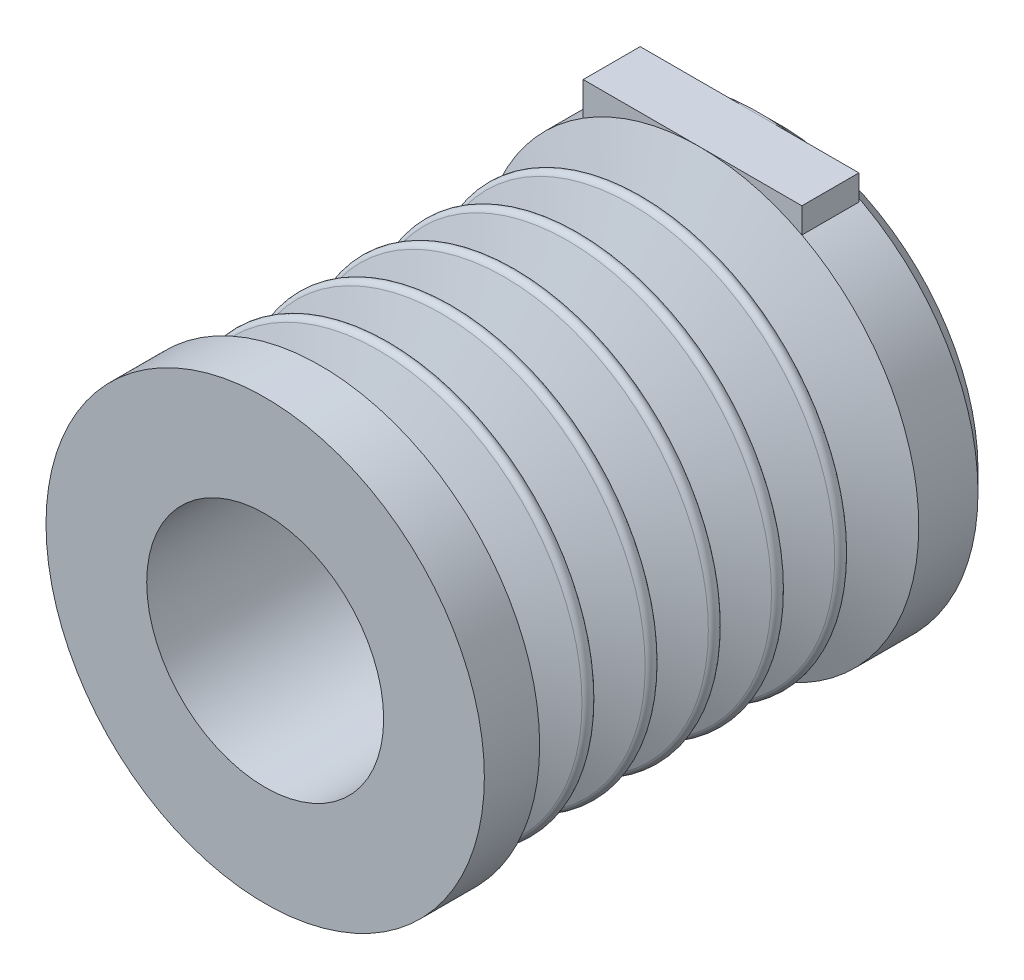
ISO-10303-21;
HEADER;
FILE_DESCRIPTION(('STEP AP214'),'2;1');
FILE_NAME('part.step','',(''),(''),'','','');
FILE_SCHEMA(('AUTOMOTIVE_DESIGN { 1 0 10303 214 1 1 1 1 }'));
ENDSEC;
DATA;
#1=APPLICATION_CONTEXT('core data for automotive mechanical design processes');
#2=APPLICATION_PROTOCOL_DEFINITION('international standard','automotive_design',2000,#1);
#3=PRODUCT_CONTEXT('',#1,'mechanical');
#4=PRODUCT('Part','Part','',(#3));
#5=PRODUCT_RELATED_PRODUCT_CATEGORY('part','',(#4));
#6=PRODUCT_DEFINITION_FORMATION('','',#4);
#7=PRODUCT_DEFINITION_CONTEXT('part definition',#1,'design');
#8=PRODUCT_DEFINITION('design','',#6,#7);
#9=PRODUCT_DEFINITION_SHAPE('','',#8);
#10=(LENGTH_UNIT() NAMED_UNIT(*) SI_UNIT(.MILLI.,.METRE.));
#11=(NAMED_UNIT(*) PLANE_ANGLE_UNIT() SI_UNIT($,.RADIAN.));
#12=(NAMED_UNIT(*) SI_UNIT($,.STERADIAN.) SOLID_ANGLE_UNIT());
#13=UNCERTAINTY_MEASURE_WITH_UNIT(LENGTH_MEASURE(1.E-05),#10,'distance_accuracy_value','');
#14=(GEOMETRIC_REPRESENTATION_CONTEXT(3) GLOBAL_UNCERTAINTY_ASSIGNED_CONTEXT((#13)) GLOBAL_UNIT_ASSIGNED_CONTEXT((#10,
#11,#12)) REPRESENTATION_CONTEXT('',''));
#15=CARTESIAN_POINT('',(0.,0.,0.));
#16=DIRECTION('',(0.,0.,1.));
#17=DIRECTION('',(1.,0.,0.));
#18=AXIS2_PLACEMENT_3D('',#15,#16,#17);
#19=CARTESIAN_POINT('',(0.,0.,21.5));
#20=DIRECTION('',(0.,0.,1.));
#21=DIRECTION('',(1.,0.,0.));
#22=AXIS2_PLACEMENT_3D('',#19,#20,#21);
#23=CYLINDRICAL_SURFACE('',#22,5.55);
#24=CARTESIAN_POINT('',(0.,0.,13.));
#25=DIRECTION('',(0.,0.,1.));
#26=DIRECTION('',(1.,0.,0.));
#27=AXIS2_PLACEMENT_3D('',#24,#25,#26);
#28=CIRCLE('',#27,5.55);
#29=CARTESIAN_POINT('',(5.55,0.,13.));
#30=VERTEX_POINT('',#29);
#31=EDGE_CURVE('E135',#30,#30,#28,.T.);
#32=ORIENTED_EDGE('',*,*,#31,.F.);
#33=EDGE_LOOP('',(#32));
#34=FACE_BOUND('',#33,.T.);
#35=CARTESIAN_POINT('',(0.,0.,11.6000000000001));
#36=DIRECTION('',(0.,0.,1.));
#37=DIRECTION('',(1.,0.,0.));
#38=AXIS2_PLACEMENT_3D('',#35,#36,#37);
#39=CIRCLE('',#38,5.55);
#40=CARTESIAN_POINT('',(5.55,0.,11.6000000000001));
#41=VERTEX_POINT('',#40);
#42=EDGE_CURVE('E119',#41,#41,#39,.T.);
#43=ORIENTED_EDGE('',*,*,#42,.T.);
#44=EDGE_LOOP('',(#43));
#45=FACE_BOUND('',#44,.T.);
#46=ADVANCED_FACE('F33',(#34,#45),#23,.T.);
#47=CARTESIAN_POINT('',(0.,5.55,13.));
#48=DIRECTION('',(0.,0.,-1.));
#49=DIRECTION('',(-1.,0.,0.));
#50=AXIS2_PLACEMENT_3D('',#47,#48,#49);
#51=PLANE('',#50);
#52=CARTESIAN_POINT('',(0.,0.,13.));
#53=DIRECTION('',(0.,0.,1.));
#54=DIRECTION('',(1.,0.,0.));
#55=AXIS2_PLACEMENT_3D('',#52,#53,#54);
#56=CIRCLE('',#55,3.);
#57=CARTESIAN_POINT('',(3.,0.,13.));
#58=VERTEX_POINT('',#57);
#59=EDGE_CURVE('E132',#58,#58,#56,.T.);
#60=ORIENTED_EDGE('',*,*,#59,.F.);
#61=EDGE_LOOP('',(#60));
#62=FACE_BOUND('',#61,.T.);
#63=ORIENTED_EDGE('',*,*,#31,.T.);
#64=EDGE_LOOP('',(#63));
#65=FACE_BOUND('',#64,.T.);
#66=ADVANCED_FACE('F227',(#62,#65),#51,.F.);
#67=CARTESIAN_POINT('',(0.,0.,21.5));
#68=DIRECTION('',(0.,0.,1.));
#69=DIRECTION('',(1.,0.,0.));
#70=AXIS2_PLACEMENT_3D('',#67,#68,#69);
#71=CYLINDRICAL_SURFACE('',#70,3.);
#72=CARTESIAN_POINT('',(0.,0.,0.));
#73=DIRECTION('',(0.,0.,1.));
#74=DIRECTION('',(1.,0.,0.));
#75=AXIS2_PLACEMENT_3D('',#72,#73,#74);
#76=CIRCLE('',#75,3.);
#77=CARTESIAN_POINT('',(3.,0.,0.));
#78=VERTEX_POINT('',#77);
#79=EDGE_CURVE('E129',#78,#78,#76,.T.);
#80=ORIENTED_EDGE('',*,*,#79,.F.);
#81=EDGE_LOOP('',(#80));
#82=FACE_BOUND('',#81,.T.);
#83=ORIENTED_EDGE('',*,*,#59,.T.);
#84=EDGE_LOOP('',(#83));
#85=FACE_BOUND('',#84,.T.);
#86=ADVANCED_FACE('F233',(#82,#85),#71,.F.);
#87=CARTESIAN_POINT('',(0.,5.55,0.));
#88=DIRECTION('',(0.,0.,1.));
#89=DIRECTION('',(1.,0.,0.));
#90=AXIS2_PLACEMENT_3D('',#87,#88,#89);
#91=PLANE('',#90);
#92=CARTESIAN_POINT('',(0.,0.,0.));
#93=DIRECTION('',(0.,0.,1.));
#94=DIRECTION('',(1.,0.,0.));
#95=AXIS2_PLACEMENT_3D('',#92,#93,#94);
#96=CIRCLE('',#95,5.05);
#97=CARTESIAN_POINT('',(5.05,0.,0.));
#98=VERTEX_POINT('',#97);
#99=EDGE_CURVE('E11',#98,#98,#96,.F.);
#100=ORIENTED_EDGE('',*,*,#99,.T.);
#101=EDGE_LOOP('',(#100));
#102=FACE_BOUND('',#101,.T.);
#103=ORIENTED_EDGE('',*,*,#79,.T.);
#104=EDGE_LOOP('',(#103));
#105=FACE_BOUND('',#104,.T.);
#106=ADVANCED_FACE('F341',(#102,#105),#91,.F.);
#107=CARTESIAN_POINT('',(0.,0.,21.5));
#108=DIRECTION('',(0.,0.,1.));
#109=DIRECTION('',(1.,0.,0.));
#110=AXIS2_PLACEMENT_3D('',#107,#108,#109);
#111=CYLINDRICAL_SURFACE('',#110,5.55);
#112=CARTESIAN_POINT('',(0.,0.,0.5));
#113=DIRECTION('',(0.,0.,1.));
#114=DIRECTION('',(1.,0.,0.));
#115=AXIS2_PLACEMENT_3D('',#112,#113,#114);
#116=CIRCLE('',#115,5.55);
#117=CARTESIAN_POINT('',(5.55,0.,0.5));
#118=VERTEX_POINT('',#117);
#119=EDGE_CURVE('E41',#118,#118,#116,.T.);
#120=ORIENTED_EDGE('',*,*,#119,.T.);
#121=EDGE_LOOP('',(#120));
#122=FACE_BOUND('',#121,.T.);
#123=CARTESIAN_POINT('',(0.,0.,0.556514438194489));
#124=DIRECTION('',(0.,0.,-1.));
#125=DIRECTION('',(-1.,0.,0.));
#126=AXIS2_PLACEMENT_3D('',#123,#124,#125);
#127=CIRCLE('',#126,5.55);
#128=CARTESIAN_POINT('',(0.,5.55,0.556514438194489));
#129=VERTEX_POINT('',#128);
#130=CARTESIAN_POINT('',(-2.94745199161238,4.70266166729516,0.556514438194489));
#131=VERTEX_POINT('',#130);
#132=EDGE_CURVE('E103',#129,#131,#127,.F.);
#133=ORIENTED_EDGE('',*,*,#132,.F.);
#134=CARTESIAN_POINT('',(0.,0.,0.556514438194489));
#135=DIRECTION('',(0.,0.,-1.));
#136=DIRECTION('',(-1.,0.,0.));
#137=AXIS2_PLACEMENT_3D('',#134,#135,#136);
#138=CIRCLE('',#137,5.55);
#139=CARTESIAN_POINT('',(2.59062137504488,4.90827677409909,0.556514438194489));
#140=VERTEX_POINT('',#139);
#141=EDGE_CURVE('E90',#140,#129,#138,.F.);
#142=ORIENTED_EDGE('',*,*,#141,.F.);
#143=DIRECTION('',(0.,0.,1.));
#144=VECTOR('',#143,1.);
#145=CARTESIAN_POINT('',(2.59062137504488,4.90827677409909,21.5));
#146=LINE('',#145,#144);
#147=CARTESIAN_POINT('',(2.59062137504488,4.90827677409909,2.));
#148=VERTEX_POINT('',#147);
#149=EDGE_CURVE('E79',#148,#140,#146,.F.);
#150=ORIENTED_EDGE('',*,*,#149,.F.);
#151=CARTESIAN_POINT('',(0.,0.,2.));
#152=DIRECTION('',(0.,0.,1.));
#153=DIRECTION('',(1.,0.,0.));
#154=AXIS2_PLACEMENT_3D('',#151,#152,#153);
#155=CIRCLE('',#154,5.55);
#156=CARTESIAN_POINT('',(-2.94745199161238,4.70266166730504,2.));
#157=VERTEX_POINT('',#156);
#158=EDGE_CURVE('E125',#157,#148,#155,.T.);
#159=ORIENTED_EDGE('',*,*,#158,.F.);
#160=DIRECTION('',(0.,0.,1.));
#161=VECTOR('',#160,1.);
#162=CARTESIAN_POINT('',(-2.94745199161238,4.70266166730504,21.5));
#163=LINE('',#162,#161);
#164=EDGE_CURVE('E107',#131,#157,#163,.T.);
#165=ORIENTED_EDGE('',*,*,#164,.F.);
#166=EDGE_LOOP('',(#133,#142,#150,#159,#165));
#167=FACE_BOUND('',#166,.T.);
#168=ADVANCED_FACE('F101',(#122,#167),#111,.T.);
#169=CARTESIAN_POINT('',(0.,0.,2.));
#170=DIRECTION('',(0.,0.,-1.));
#171=DIRECTION('',(-1.,0.,0.));
#172=AXIS2_PLACEMENT_3D('',#169,#170,#171);
#173=CONICAL_SURFACE('',#172,5.55,1.22173047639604);
#174=CARTESIAN_POINT('',(0.,0.,2.61206147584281));
#175=DIRECTION('',(0.,0.,-1.));
#176=DIRECTION('',(-1.,0.,0.));
#177=AXIS2_PLACEMENT_3D('',#174,#175,#176);
#178=CIRCLE('',#177,3.86837491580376);
#179=CARTESIAN_POINT('',(-3.86837491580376,0.,2.61206147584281));
#180=VERTEX_POINT('',#179);
#181=EDGE_CURVE('E171',#180,#180,#178,.T.);
#182=ORIENTED_EDGE('',*,*,#181,.T.);
#183=EDGE_LOOP('',(#182));
#184=FACE_BOUND('',#183,.T.);
#185=CARTESIAN_POINT('',(0.,5.55,2.));
#186=VERTEX_POINT('',#185);
#187=EDGE_CURVE('E126',#186,#157,#155,.T.);
#188=ORIENTED_EDGE('',*,*,#187,.T.);
#189=ORIENTED_EDGE('',*,*,#158,.T.);
#190=CARTESIAN_POINT('',(0.,0.,2.));
#191=DIRECTION('',(0.,0.,1.));
#192=DIRECTION('',(1.,0.,0.));
#193=AXIS2_PLACEMENT_3D('',#190,#191,#192);
#194=CIRCLE('',#193,5.55);
#195=EDGE_CURVE('E98',#186,#148,#194,.F.);
#196=ORIENTED_EDGE('',*,*,#195,.F.);
#197=EDGE_LOOP('',(#188,#189,#196));
#198=FACE_BOUND('',#197,.T.);
#199=ADVANCED_FACE('F334',(#184,#198),#173,.T.);
#200=CARTESIAN_POINT('',(0.,0.,2.79999999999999));
#201=DIRECTION('',(0.,0.,1.));
#202=DIRECTION('',(1.,0.,0.));
#203=AXIS2_PLACEMENT_3D('',#200,#201,#202);
#204=CONICAL_SURFACE('',#203,3.35201806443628,1.22173047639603);
#205=CARTESIAN_POINT('',(0.,0.,2.98793852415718));
#206=DIRECTION('',(0.,0.,1.));
#207=DIRECTION('',(1.,0.,0.));
#208=AXIS2_PLACEMENT_3D('',#205,#206,#207);
#209=CIRCLE('',#208,3.86837491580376);
#210=CARTESIAN_POINT('',(3.86837491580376,0.,2.98793852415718));
#211=VERTEX_POINT('',#210);
#212=EDGE_CURVE('E168',#211,#211,#209,.T.);
#213=ORIENTED_EDGE('',*,*,#212,.T.);
#214=EDGE_LOOP('',(#213));
#215=FACE_BOUND('',#214,.T.);
#216=CARTESIAN_POINT('',(0.,0.,3.45904610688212));
#217=DIRECTION('',(0.,0.,-1.));
#218=DIRECTION('',(-1.,0.,0.));
#219=AXIS2_PLACEMENT_3D('',#216,#217,#218);
#220=CIRCLE('',#219,5.16273236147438);
#221=CARTESIAN_POINT('',(-5.16273236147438,0.,3.45904610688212));
#222=VERTEX_POINT('',#221);
#223=EDGE_CURVE('E141',#222,#222,#220,.T.);
#224=ORIENTED_EDGE('',*,*,#223,.T.);
#225=EDGE_LOOP('',(#224));
#226=FACE_BOUND('',#225,.T.);
#227=ADVANCED_FACE('F330',(#215,#226),#204,.T.);
#228=CARTESIAN_POINT('',(0.,0.,3.60000000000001));
#229=DIRECTION('',(0.,0.,-1.));
#230=DIRECTION('',(-1.,0.,0.));
#231=AXIS2_PLACEMENT_3D('',#228,#229,#230);
#232=CONICAL_SURFACE('',#231,5.55,1.22173047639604);
#233=CARTESIAN_POINT('',(0.,0.,4.21206147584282));
#234=DIRECTION('',(0.,0.,-1.));
#235=DIRECTION('',(-1.,0.,0.));
#236=AXIS2_PLACEMENT_3D('',#233,#234,#235);
#237=CIRCLE('',#236,3.86837491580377);
#238=CARTESIAN_POINT('',(-3.86837491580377,0.,4.21206147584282));
#239=VERTEX_POINT('',#238);
#240=EDGE_CURVE('E177',#239,#239,#237,.T.);
#241=ORIENTED_EDGE('',*,*,#240,.T.);
#242=EDGE_LOOP('',(#241));
#243=FACE_BOUND('',#242,.T.);
#244=CARTESIAN_POINT('',(0.,0.,3.74095389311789));
#245=DIRECTION('',(0.,0.,1.));
#246=DIRECTION('',(1.,0.,0.));
#247=AXIS2_PLACEMENT_3D('',#244,#245,#246);
#248=CIRCLE('',#247,5.16273236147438);
#249=CARTESIAN_POINT('',(5.16273236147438,0.,3.74095389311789));
#250=VERTEX_POINT('',#249);
#251=EDGE_CURVE('E138',#250,#250,#248,.T.);
#252=ORIENTED_EDGE('',*,*,#251,.T.);
#253=EDGE_LOOP('',(#252));
#254=FACE_BOUND('',#253,.T.);
#255=ADVANCED_FACE('F326',(#243,#254),#232,.T.);
#256=CARTESIAN_POINT('',(0.,0.,4.39999999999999));
#257=DIRECTION('',(0.,0.,1.));
#258=DIRECTION('',(1.,0.,0.));
#259=AXIS2_PLACEMENT_3D('',#256,#257,#258);
#260=CONICAL_SURFACE('',#259,3.35201806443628,1.22173047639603);
#261=CARTESIAN_POINT('',(0.,0.,4.58793852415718));
#262=DIRECTION('',(0.,0.,1.));
#263=DIRECTION('',(1.,0.,0.));
#264=AXIS2_PLACEMENT_3D('',#261,#262,#263);
#265=CIRCLE('',#264,3.86837491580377);
#266=CARTESIAN_POINT('',(3.86837491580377,0.,4.58793852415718));
#267=VERTEX_POINT('',#266);
#268=EDGE_CURVE('E174',#267,#267,#265,.T.);
#269=ORIENTED_EDGE('',*,*,#268,.T.);
#270=EDGE_LOOP('',(#269));
#271=FACE_BOUND('',#270,.T.);
#272=CARTESIAN_POINT('',(0.,0.,5.05904610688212));
#273=DIRECTION('',(0.,0.,-1.));
#274=DIRECTION('',(-1.,0.,0.));
#275=AXIS2_PLACEMENT_3D('',#272,#273,#274);
#276=CIRCLE('',#275,5.16273236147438);
#277=CARTESIAN_POINT('',(-5.16273236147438,0.,5.05904610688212));
#278=VERTEX_POINT('',#277);
#279=EDGE_CURVE('E147',#278,#278,#276,.T.);
#280=ORIENTED_EDGE('',*,*,#279,.T.);
#281=EDGE_LOOP('',(#280));
#282=FACE_BOUND('',#281,.T.);
#283=ADVANCED_FACE('F322',(#271,#282),#260,.T.);
#284=CARTESIAN_POINT('',(0.,0.,5.20000000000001));
#285=DIRECTION('',(0.,0.,-1.));
#286=DIRECTION('',(-1.,0.,0.));
#287=AXIS2_PLACEMENT_3D('',#284,#285,#286);
#288=CONICAL_SURFACE('',#287,5.55,1.22173047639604);
#289=CARTESIAN_POINT('',(0.,0.,5.81206147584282));
#290=DIRECTION('',(0.,0.,-1.));
#291=DIRECTION('',(-1.,0.,0.));
#292=AXIS2_PLACEMENT_3D('',#289,#290,#291);
#293=CIRCLE('',#292,3.86837491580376);
#294=CARTESIAN_POINT('',(-3.86837491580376,0.,5.81206147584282));
#295=VERTEX_POINT('',#294);
#296=EDGE_CURVE('E183',#295,#295,#293,.T.);
#297=ORIENTED_EDGE('',*,*,#296,.T.);
#298=EDGE_LOOP('',(#297));
#299=FACE_BOUND('',#298,.T.);
#300=CARTESIAN_POINT('',(0.,0.,5.3409538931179));
#301=DIRECTION('',(0.,0.,1.));
#302=DIRECTION('',(1.,0.,0.));
#303=AXIS2_PLACEMENT_3D('',#300,#301,#302);
#304=CIRCLE('',#303,5.16273236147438);
#305=CARTESIAN_POINT('',(5.16273236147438,0.,5.3409538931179));
#306=VERTEX_POINT('',#305);
#307=EDGE_CURVE('E144',#306,#306,#304,.T.);
#308=ORIENTED_EDGE('',*,*,#307,.T.);
#309=EDGE_LOOP('',(#308));
#310=FACE_BOUND('',#309,.T.);
#311=ADVANCED_FACE('F318',(#299,#310),#288,.T.);
#312=CARTESIAN_POINT('',(0.,0.,6.));
#313=DIRECTION('',(0.,0.,1.));
#314=DIRECTION('',(1.,0.,0.));
#315=AXIS2_PLACEMENT_3D('',#312,#313,#314);
#316=CONICAL_SURFACE('',#315,3.35201806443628,1.22173047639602);
#317=CARTESIAN_POINT('',(0.,0.,6.18793852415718));
#318=DIRECTION('',(0.,0.,1.));
#319=DIRECTION('',(1.,0.,0.));
#320=AXIS2_PLACEMENT_3D('',#317,#318,#319);
#321=CIRCLE('',#320,3.86837491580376);
#322=CARTESIAN_POINT('',(3.86837491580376,0.,6.18793852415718));
#323=VERTEX_POINT('',#322);
#324=EDGE_CURVE('E180',#323,#323,#321,.T.);
#325=ORIENTED_EDGE('',*,*,#324,.T.);
#326=EDGE_LOOP('',(#325));
#327=FACE_BOUND('',#326,.T.);
#328=CARTESIAN_POINT('',(0.,0.,6.65904610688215));
#329=DIRECTION('',(0.,0.,-1.));
#330=DIRECTION('',(-1.,0.,0.));
#331=AXIS2_PLACEMENT_3D('',#328,#329,#330);
#332=CIRCLE('',#331,5.1627323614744);
#333=CARTESIAN_POINT('',(-5.1627323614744,0.,6.65904610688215));
#334=VERTEX_POINT('',#333);
#335=EDGE_CURVE('E153',#334,#334,#332,.T.);
#336=ORIENTED_EDGE('',*,*,#335,.T.);
#337=EDGE_LOOP('',(#336));
#338=FACE_BOUND('',#337,.T.);
#339=ADVANCED_FACE('F314',(#327,#338),#316,.T.);
#340=CARTESIAN_POINT('',(0.,0.,6.80000000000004));
#341=DIRECTION('',(0.,0.,-1.));
#342=DIRECTION('',(-1.,0.,0.));
#343=AXIS2_PLACEMENT_3D('',#340,#341,#342);
#344=CONICAL_SURFACE('',#343,5.55,1.22173047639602);
#345=CARTESIAN_POINT('',(0.,0.,7.41206147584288));
#346=DIRECTION('',(0.,0.,-1.));
#347=DIRECTION('',(-1.,0.,0.));
#348=AXIS2_PLACEMENT_3D('',#345,#346,#347);
#349=CIRCLE('',#348,3.86837491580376);
#350=CARTESIAN_POINT('',(-3.86837491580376,0.,7.41206147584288));
#351=VERTEX_POINT('',#350);
#352=EDGE_CURVE('E189',#351,#351,#349,.T.);
#353=ORIENTED_EDGE('',*,*,#352,.T.);
#354=EDGE_LOOP('',(#353));
#355=FACE_BOUND('',#354,.T.);
#356=CARTESIAN_POINT('',(0.,0.,6.94095389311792));
#357=DIRECTION('',(0.,0.,1.));
#358=DIRECTION('',(1.,0.,0.));
#359=AXIS2_PLACEMENT_3D('',#356,#357,#358);
#360=CIRCLE('',#359,5.1627323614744);
#361=CARTESIAN_POINT('',(5.1627323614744,0.,6.94095389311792));
#362=VERTEX_POINT('',#361);
#363=EDGE_CURVE('E150',#362,#362,#360,.T.);
#364=ORIENTED_EDGE('',*,*,#363,.T.);
#365=EDGE_LOOP('',(#364));
#366=FACE_BOUND('',#365,.T.);
#367=ADVANCED_FACE('F310',(#355,#366),#344,.T.);
#368=CARTESIAN_POINT('',(0.,0.,7.60000000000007));
#369=DIRECTION('',(0.,0.,1.));
#370=DIRECTION('',(1.,0.,0.));
#371=AXIS2_PLACEMENT_3D('',#368,#369,#370);
#372=CONICAL_SURFACE('',#371,3.35201806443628,1.22173047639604);
#373=CARTESIAN_POINT('',(0.,0.,7.78793852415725));
#374=DIRECTION('',(0.,0.,1.));
#375=DIRECTION('',(1.,0.,0.));
#376=AXIS2_PLACEMENT_3D('',#373,#374,#375);
#377=CIRCLE('',#376,3.86837491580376);
#378=CARTESIAN_POINT('',(3.86837491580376,0.,7.78793852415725));
#379=VERTEX_POINT('',#378);
#380=EDGE_CURVE('E186',#379,#379,#377,.T.);
#381=ORIENTED_EDGE('',*,*,#380,.T.);
#382=EDGE_LOOP('',(#381));
#383=FACE_BOUND('',#382,.T.);
#384=CARTESIAN_POINT('',(0.,0.,8.25904610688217));
#385=DIRECTION('',(0.,0.,-1.));
#386=DIRECTION('',(-1.,0.,0.));
#387=AXIS2_PLACEMENT_3D('',#384,#385,#386);
#388=CIRCLE('',#387,5.16273236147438);
#389=CARTESIAN_POINT('',(-5.16273236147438,0.,8.25904610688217));
#390=VERTEX_POINT('',#389);
#391=EDGE_CURVE('E159',#390,#390,#388,.T.);
#392=ORIENTED_EDGE('',*,*,#391,.T.);
#393=EDGE_LOOP('',(#392));
#394=FACE_BOUND('',#393,.T.);
#395=ADVANCED_FACE('F306',(#383,#394),#372,.T.);
#396=CARTESIAN_POINT('',(0.,0.,8.40000000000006));
#397=DIRECTION('',(0.,0.,-1.));
#398=DIRECTION('',(-1.,0.,0.));
#399=AXIS2_PLACEMENT_3D('',#396,#397,#398);
#400=CONICAL_SURFACE('',#399,5.55,1.22173047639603);
#401=CARTESIAN_POINT('',(0.,0.,9.01206147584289));
#402=DIRECTION('',(0.,0.,-1.));
#403=DIRECTION('',(-1.,0.,0.));
#404=AXIS2_PLACEMENT_3D('',#401,#402,#403);
#405=CIRCLE('',#404,3.86837491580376);
#406=CARTESIAN_POINT('',(-3.86837491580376,0.,9.01206147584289));
#407=VERTEX_POINT('',#406);
#408=EDGE_CURVE('E195',#407,#407,#405,.T.);
#409=ORIENTED_EDGE('',*,*,#408,.T.);
#410=EDGE_LOOP('',(#409));
#411=FACE_BOUND('',#410,.T.);
#412=CARTESIAN_POINT('',(0.,0.,8.54095389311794));
#413=DIRECTION('',(0.,0.,1.));
#414=DIRECTION('',(1.,0.,0.));
#415=AXIS2_PLACEMENT_3D('',#412,#413,#414);
#416=CIRCLE('',#415,5.16273236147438);
#417=CARTESIAN_POINT('',(5.16273236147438,0.,8.54095389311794));
#418=VERTEX_POINT('',#417);
#419=EDGE_CURVE('E156',#418,#418,#416,.T.);
#420=ORIENTED_EDGE('',*,*,#419,.T.);
#421=EDGE_LOOP('',(#420));
#422=FACE_BOUND('',#421,.T.);
#423=ADVANCED_FACE('F289',(#411,#422),#400,.T.);
#424=CARTESIAN_POINT('',(0.,0.,9.20000000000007));
#425=DIRECTION('',(0.,0.,1.));
#426=DIRECTION('',(1.,0.,0.));
#427=AXIS2_PLACEMENT_3D('',#424,#425,#426);
#428=CONICAL_SURFACE('',#427,3.35201806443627,1.22173047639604);
#429=CARTESIAN_POINT('',(0.,0.,9.38793852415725));
#430=DIRECTION('',(0.,0.,1.));
#431=DIRECTION('',(1.,0.,0.));
#432=AXIS2_PLACEMENT_3D('',#429,#430,#431);
#433=CIRCLE('',#432,3.86837491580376);
#434=CARTESIAN_POINT('',(3.86837491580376,0.,9.38793852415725));
#435=VERTEX_POINT('',#434);
#436=EDGE_CURVE('E192',#435,#435,#433,.T.);
#437=ORIENTED_EDGE('',*,*,#436,.T.);
#438=EDGE_LOOP('',(#437));
#439=FACE_BOUND('',#438,.T.);
#440=CARTESIAN_POINT('',(0.,0.,9.85904610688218));
#441=DIRECTION('',(0.,0.,-1.));
#442=DIRECTION('',(-1.,0.,0.));
#443=AXIS2_PLACEMENT_3D('',#440,#441,#442);
#444=CIRCLE('',#443,5.16273236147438);
#445=CARTESIAN_POINT('',(-5.16273236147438,0.,9.85904610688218));
#446=VERTEX_POINT('',#445);
#447=EDGE_CURVE('E165',#446,#446,#444,.T.);
#448=ORIENTED_EDGE('',*,*,#447,.T.);
#449=EDGE_LOOP('',(#448));
#450=FACE_BOUND('',#449,.T.);
#451=ADVANCED_FACE('F285',(#439,#450),#428,.T.);
#452=CARTESIAN_POINT('',(0.,0.,10.0000000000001));
#453=DIRECTION('',(0.,0.,-1.));
#454=DIRECTION('',(-1.,0.,0.));
#455=AXIS2_PLACEMENT_3D('',#452,#453,#454);
#456=CONICAL_SURFACE('',#455,5.55,1.22173047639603);
#457=CARTESIAN_POINT('',(0.,0.,10.6120614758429));
#458=DIRECTION('',(0.,0.,-1.));
#459=DIRECTION('',(-1.,0.,0.));
#460=AXIS2_PLACEMENT_3D('',#457,#458,#459);
#461=CIRCLE('',#460,3.86837491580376);
#462=CARTESIAN_POINT('',(-3.86837491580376,0.,10.6120614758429));
#463=VERTEX_POINT('',#462);
#464=EDGE_CURVE('E201',#463,#463,#461,.T.);
#465=ORIENTED_EDGE('',*,*,#464,.T.);
#466=EDGE_LOOP('',(#465));
#467=FACE_BOUND('',#466,.T.);
#468=CARTESIAN_POINT('',(0.,0.,10.140953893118));
#469=DIRECTION('',(0.,0.,1.));
#470=DIRECTION('',(1.,0.,0.));
#471=AXIS2_PLACEMENT_3D('',#468,#469,#470);
#472=CIRCLE('',#471,5.16273236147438);
#473=CARTESIAN_POINT('',(5.16273236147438,0.,10.140953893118));
#474=VERTEX_POINT('',#473);
#475=EDGE_CURVE('E162',#474,#474,#472,.T.);
#476=ORIENTED_EDGE('',*,*,#475,.T.);
#477=EDGE_LOOP('',(#476));
#478=FACE_BOUND('',#477,.T.);
#479=ADVANCED_FACE('F288',(#467,#478),#456,.T.);
#480=CARTESIAN_POINT('',(0.,0.,10.8000000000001));
#481=DIRECTION('',(0.,0.,1.));
#482=DIRECTION('',(1.,0.,0.));
#483=AXIS2_PLACEMENT_3D('',#480,#481,#482);
#484=CONICAL_SURFACE('',#483,3.35201806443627,1.22173047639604);
#485=CARTESIAN_POINT('',(0.,0.,10.9879385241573));
#486=DIRECTION('',(0.,0.,1.));
#487=DIRECTION('',(1.,0.,0.));
#488=AXIS2_PLACEMENT_3D('',#485,#486,#487);
#489=CIRCLE('',#488,3.86837491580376);
#490=CARTESIAN_POINT('',(3.86837491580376,0.,10.9879385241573));
#491=VERTEX_POINT('',#490);
#492=EDGE_CURVE('E198',#491,#491,#489,.T.);
#493=ORIENTED_EDGE('',*,*,#492,.T.);
#494=EDGE_LOOP('',(#493));
#495=FACE_BOUND('',#494,.T.);
#496=ORIENTED_EDGE('',*,*,#42,.F.);
#497=EDGE_LOOP('',(#496));
#498=FACE_BOUND('',#497,.T.);
#499=ADVANCED_FACE('F244',(#495,#498),#484,.T.);
#500=CARTESIAN_POINT('',(0.,0.,3.6));
#501=DIRECTION('',(0.,0.,-1.));
#502=DIRECTION('',(-1.,0.,0.));
#503=AXIS2_PLACEMENT_3D('',#500,#501,#502);
#504=TOROIDAL_SURFACE('',#503,5.11142933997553,0.15);
#505=ORIENTED_EDGE('',*,*,#223,.F.);
#506=EDGE_LOOP('',(#505));
#507=FACE_BOUND('',#506,.T.);
#508=ORIENTED_EDGE('',*,*,#251,.F.);
#509=EDGE_LOOP('',(#508));
#510=FACE_BOUND('',#509,.T.);
#511=ADVANCED_FACE('F240',(#507,#510),#504,.T.);
#512=CARTESIAN_POINT('',(0.,0.,5.20000000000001));
#513=DIRECTION('',(0.,0.,-1.));
#514=DIRECTION('',(-1.,0.,0.));
#515=AXIS2_PLACEMENT_3D('',#512,#513,#514);
#516=TOROIDAL_SURFACE('',#515,5.11142933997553,0.15);
#517=ORIENTED_EDGE('',*,*,#279,.F.);
#518=EDGE_LOOP('',(#517));
#519=FACE_BOUND('',#518,.T.);
#520=ORIENTED_EDGE('',*,*,#307,.F.);
#521=EDGE_LOOP('',(#520));
#522=FACE_BOUND('',#521,.T.);
#523=ADVANCED_FACE('F243',(#519,#522),#516,.T.);
#524=CARTESIAN_POINT('',(0.,0.,6.80000000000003));
#525=DIRECTION('',(0.,0.,-1.));
#526=DIRECTION('',(-1.,0.,0.));
#527=AXIS2_PLACEMENT_3D('',#524,#525,#526);
#528=TOROIDAL_SURFACE('',#527,5.11142933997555,0.15);
#529=ORIENTED_EDGE('',*,*,#335,.F.);
#530=EDGE_LOOP('',(#529));
#531=FACE_BOUND('',#530,.T.);
#532=ORIENTED_EDGE('',*,*,#363,.F.);
#533=EDGE_LOOP('',(#532));
#534=FACE_BOUND('',#533,.T.);
#535=ADVANCED_FACE('F248',(#531,#534),#528,.T.);
#536=CARTESIAN_POINT('',(0.,0.,8.40000000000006));
#537=DIRECTION('',(0.,0.,-1.));
#538=DIRECTION('',(-1.,0.,0.));
#539=AXIS2_PLACEMENT_3D('',#536,#537,#538);
#540=TOROIDAL_SURFACE('',#539,5.11142933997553,0.15);
#541=ORIENTED_EDGE('',*,*,#391,.F.);
#542=EDGE_LOOP('',(#541));
#543=FACE_BOUND('',#542,.T.);
#544=ORIENTED_EDGE('',*,*,#419,.F.);
#545=EDGE_LOOP('',(#544));
#546=FACE_BOUND('',#545,.T.);
#547=ADVANCED_FACE('F252',(#543,#546),#540,.T.);
#548=CARTESIAN_POINT('',(0.,0.,10.0000000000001));
#549=DIRECTION('',(0.,0.,-1.));
#550=DIRECTION('',(-1.,0.,0.));
#551=AXIS2_PLACEMENT_3D('',#548,#549,#550);
#552=TOROIDAL_SURFACE('',#551,5.11142933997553,0.15);
#553=ORIENTED_EDGE('',*,*,#447,.F.);
#554=EDGE_LOOP('',(#553));
#555=FACE_BOUND('',#554,.T.);
#556=ORIENTED_EDGE('',*,*,#475,.F.);
#557=EDGE_LOOP('',(#556));
#558=FACE_BOUND('',#557,.T.);
#559=ADVANCED_FACE('F256',(#555,#558),#552,.T.);
#560=CARTESIAN_POINT('',(0.,0.,2.8));
#561=DIRECTION('',(0.,0.,1.));
#562=DIRECTION('',(1.,0.,0.));
#563=AXIS2_PLACEMENT_3D('',#560,#561,#562);
#564=TOROIDAL_SURFACE('',#563,3.9367789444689,0.2);
#565=ORIENTED_EDGE('',*,*,#181,.F.);
#566=EDGE_LOOP('',(#565));
#567=FACE_BOUND('',#566,.T.);
#568=ORIENTED_EDGE('',*,*,#212,.F.);
#569=EDGE_LOOP('',(#568));
#570=FACE_BOUND('',#569,.T.);
#571=ADVANCED_FACE('F260',(#567,#570),#564,.F.);
#572=CARTESIAN_POINT('',(0.,0.,4.4));
#573=DIRECTION('',(0.,0.,1.));
#574=DIRECTION('',(1.,0.,0.));
#575=AXIS2_PLACEMENT_3D('',#572,#573,#574);
#576=TOROIDAL_SURFACE('',#575,3.9367789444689,0.2);
#577=ORIENTED_EDGE('',*,*,#240,.F.);
#578=EDGE_LOOP('',(#577));
#579=FACE_BOUND('',#578,.T.);
#580=ORIENTED_EDGE('',*,*,#268,.F.);
#581=EDGE_LOOP('',(#580));
#582=FACE_BOUND('',#581,.T.);
#583=ADVANCED_FACE('F264',(#579,#582),#576,.F.);
#584=CARTESIAN_POINT('',(0.,0.,6.));
#585=DIRECTION('',(0.,0.,1.));
#586=DIRECTION('',(1.,0.,0.));
#587=AXIS2_PLACEMENT_3D('',#584,#585,#586);
#588=TOROIDAL_SURFACE('',#587,3.93677894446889,0.2);
#589=ORIENTED_EDGE('',*,*,#296,.F.);
#590=EDGE_LOOP('',(#589));
#591=FACE_BOUND('',#590,.T.);
#592=ORIENTED_EDGE('',*,*,#324,.F.);
#593=EDGE_LOOP('',(#592));
#594=FACE_BOUND('',#593,.T.);
#595=ADVANCED_FACE('F268',(#591,#594),#588,.F.);
#596=CARTESIAN_POINT('',(0.,0.,7.60000000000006));
#597=DIRECTION('',(0.,0.,1.));
#598=DIRECTION('',(1.,0.,0.));
#599=AXIS2_PLACEMENT_3D('',#596,#597,#598);
#600=TOROIDAL_SURFACE('',#599,3.93677894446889,0.2);
#601=ORIENTED_EDGE('',*,*,#352,.F.);
#602=EDGE_LOOP('',(#601));
#603=FACE_BOUND('',#602,.T.);
#604=ORIENTED_EDGE('',*,*,#380,.F.);
#605=EDGE_LOOP('',(#604));
#606=FACE_BOUND('',#605,.T.);
#607=ADVANCED_FACE('F272',(#603,#606),#600,.F.);
#608=CARTESIAN_POINT('',(0.,0.,9.20000000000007));
#609=DIRECTION('',(0.,0.,1.));
#610=DIRECTION('',(1.,0.,0.));
#611=AXIS2_PLACEMENT_3D('',#608,#609,#610);
#612=TOROIDAL_SURFACE('',#611,3.93677894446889,0.2);
#613=ORIENTED_EDGE('',*,*,#408,.F.);
#614=EDGE_LOOP('',(#613));
#615=FACE_BOUND('',#614,.T.);
#616=ORIENTED_EDGE('',*,*,#436,.F.);
#617=EDGE_LOOP('',(#616));
#618=FACE_BOUND('',#617,.T.);
#619=ADVANCED_FACE('F219',(#615,#618),#612,.F.);
#620=CARTESIAN_POINT('',(0.,0.,10.8000000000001));
#621=DIRECTION('',(0.,0.,1.));
#622=DIRECTION('',(1.,0.,0.));
#623=AXIS2_PLACEMENT_3D('',#620,#621,#622);
#624=TOROIDAL_SURFACE('',#623,3.9367789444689,0.2);
#625=ORIENTED_EDGE('',*,*,#464,.F.);
#626=EDGE_LOOP('',(#625));
#627=FACE_BOUND('',#626,.T.);
#628=ORIENTED_EDGE('',*,*,#492,.F.);
#629=EDGE_LOOP('',(#628));
#630=FACE_BOUND('',#629,.T.);
#631=ADVANCED_FACE('F209',(#627,#630),#624,.F.);
#632=CARTESIAN_POINT('',(0.,0.,0.5));
#633=DIRECTION('',(0.,0.,1.));
#634=DIRECTION('',(1.,0.,0.));
#635=AXIS2_PLACEMENT_3D('',#632,#633,#634);
#636=CONICAL_SURFACE('',#635,5.55,0.78539816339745);
#637=ORIENTED_EDGE('',*,*,#99,.F.);
#638=EDGE_LOOP('',(#637));
#639=FACE_BOUND('',#638,.T.);
#640=ORIENTED_EDGE('',*,*,#119,.F.);
#641=EDGE_LOOP('',(#640));
#642=FACE_BOUND('',#641,.T.);
#643=ADVANCED_FACE('F35',(#639,#642),#636,.T.);
#644=CARTESIAN_POINT('',(-2.94745199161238,-500000.,2.));
#645=DIRECTION('',(-1.,0.,0.));
#646=DIRECTION('',(0.,0.,1.));
#647=AXIS2_PLACEMENT_3D('',#644,#645,#646);
#648=PLANE('',#647);
#649=DIRECTION('',(0.,1.,0.));
#650=VECTOR('',#649,1.);
#651=CARTESIAN_POINT('',(-2.94745199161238,-500000.,0.556514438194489));
#652=LINE('',#651,#650);
#653=CARTESIAN_POINT('',(-2.94745199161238,5.55,0.556514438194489));
#654=VERTEX_POINT('',#653);
#655=EDGE_CURVE('E109',#131,#654,#652,.T.);
#656=ORIENTED_EDGE('',*,*,#655,.F.);
#657=ORIENTED_EDGE('',*,*,#164,.T.);
#658=DIRECTION('',(0.,1.,0.));
#659=VECTOR('',#658,1.);
#660=CARTESIAN_POINT('',(-2.94745199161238,-500000.,2.));
#661=LINE('',#660,#659);
#662=CARTESIAN_POINT('',(-2.94745199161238,5.55,2.));
#663=VERTEX_POINT('',#662);
#664=EDGE_CURVE('E48',#157,#663,#661,.T.);
#665=ORIENTED_EDGE('',*,*,#664,.T.);
#666=DIRECTION('',(0.,0.,1.));
#667=VECTOR('',#666,1.);
#668=CARTESIAN_POINT('',(-2.94745199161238,5.55,2.));
#669=LINE('',#668,#667);
#670=EDGE_CURVE('E110',#654,#663,#669,.T.);
#671=ORIENTED_EDGE('',*,*,#670,.F.);
#672=EDGE_LOOP('',(#656,#657,#665,#671));
#673=FACE_BOUND('',#672,.T.);
#674=ADVANCED_FACE('F208',(#673),#648,.T.);
#675=CARTESIAN_POINT('',(2.59062137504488,-500000.,0.556514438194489));
#676=DIRECTION('',(0.,0.,-1.));
#677=DIRECTION('',(-1.,0.,0.));
#678=AXIS2_PLACEMENT_3D('',#675,#676,#677);
#679=PLANE('',#678);
#680=DIRECTION('',(-1.,0.,0.));
#681=VECTOR('',#680,1.);
#682=CARTESIAN_POINT('',(2.59062137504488,5.55,0.556514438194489));
#683=LINE('',#682,#681);
#684=EDGE_CURVE('E113',#129,#654,#683,.T.);
#685=ORIENTED_EDGE('',*,*,#684,.F.);
#686=ORIENTED_EDGE('',*,*,#132,.T.);
#687=ORIENTED_EDGE('',*,*,#655,.T.);
#688=EDGE_LOOP('',(#685,#686,#687));
#689=FACE_BOUND('',#688,.T.);
#690=ADVANCED_FACE('F216',(#689),#679,.T.);
#691=CARTESIAN_POINT('',(2.59062137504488,-500000.,2.));
#692=DIRECTION('',(0.,0.,1.));
#693=DIRECTION('',(1.,0.,0.));
#694=AXIS2_PLACEMENT_3D('',#691,#692,#693);
#695=PLANE('',#694);
#696=ORIENTED_EDGE('',*,*,#664,.F.);
#697=ORIENTED_EDGE('',*,*,#187,.F.);
#698=DIRECTION('',(1.,0.,0.));
#699=VECTOR('',#698,1.);
#700=CARTESIAN_POINT('',(2.59062137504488,5.55,2.));
#701=LINE('',#700,#699);
#702=EDGE_CURVE('E114',#663,#186,#701,.T.);
#703=ORIENTED_EDGE('',*,*,#702,.F.);
#704=EDGE_LOOP('',(#696,#697,#703));
#705=FACE_BOUND('',#704,.T.);
#706=ADVANCED_FACE('F223',(#705),#695,.T.);
#707=CARTESIAN_POINT('',(2.59062137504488,5.55,0.556514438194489));
#708=DIRECTION('',(0.,1.,0.));
#709=DIRECTION('',(0.,0.,1.));
#710=AXIS2_PLACEMENT_3D('',#707,#708,#709);
#711=PLANE('',#710);
#712=ORIENTED_EDGE('',*,*,#702,.T.);
#713=DIRECTION('',(1.,0.,0.));
#714=VECTOR('',#713,1.);
#715=CARTESIAN_POINT('',(2.59062137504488,5.55,2.));
#716=LINE('',#715,#714);
#717=CARTESIAN_POINT('',(2.59062137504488,5.55,2.));
#718=VERTEX_POINT('',#717);
#719=EDGE_CURVE('E519',#186,#718,#716,.T.);
#720=ORIENTED_EDGE('',*,*,#719,.T.);
#721=DIRECTION('',(0.,0.,-1.));
#722=VECTOR('',#721,1.);
#723=CARTESIAN_POINT('',(2.59062137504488,5.55,2.));
#724=LINE('',#723,#722);
#725=CARTESIAN_POINT('',(2.59062137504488,5.55,0.556514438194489));
#726=VERTEX_POINT('',#725);
#727=EDGE_CURVE('E521',#718,#726,#724,.T.);
#728=ORIENTED_EDGE('',*,*,#727,.T.);
#729=DIRECTION('',(-1.,0.,0.));
#730=VECTOR('',#729,1.);
#731=CARTESIAN_POINT('',(2.59062137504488,5.55,0.556514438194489));
#732=LINE('',#731,#730);
#733=EDGE_CURVE('E96',#726,#129,#732,.T.);
#734=ORIENTED_EDGE('',*,*,#733,.T.);
#735=ORIENTED_EDGE('',*,*,#684,.T.);
#736=ORIENTED_EDGE('',*,*,#670,.T.);
#737=EDGE_LOOP('',(#712,#720,#728,#734,#735,#736));
#738=FACE_BOUND('',#737,.T.);
#739=ADVANCED_FACE('F211',(#738),#711,.T.);
#740=CARTESIAN_POINT('',(2.59062137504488,-500000.,0.556514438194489));
#741=DIRECTION('',(0.,0.,-1.));
#742=DIRECTION('',(-1.,0.,0.));
#743=AXIS2_PLACEMENT_3D('',#740,#741,#742);
#744=PLANE('',#743);
#745=DIRECTION('',(0.,1.,0.));
#746=VECTOR('',#745,1.);
#747=CARTESIAN_POINT('',(2.59062137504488,-500000.,0.556514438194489));
#748=LINE('',#747,#746);
#749=EDGE_CURVE('E83',#140,#726,#748,.T.);
#750=ORIENTED_EDGE('',*,*,#749,.F.);
#751=ORIENTED_EDGE('',*,*,#141,.T.);
#752=ORIENTED_EDGE('',*,*,#733,.F.);
#753=EDGE_LOOP('',(#750,#751,#752));
#754=FACE_BOUND('',#753,.T.);
#755=ADVANCED_FACE('F94',(#754),#744,.T.);
#756=CARTESIAN_POINT('',(2.59062137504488,-500000.,2.));
#757=DIRECTION('',(1.,0.,0.));
#758=DIRECTION('',(0.,0.,-1.));
#759=AXIS2_PLACEMENT_3D('',#756,#757,#758);
#760=PLANE('',#759);
#761=DIRECTION('',(0.,1.,0.));
#762=VECTOR('',#761,1.);
#763=CARTESIAN_POINT('',(2.59062137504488,-500000.,2.));
#764=LINE('',#763,#762);
#765=EDGE_CURVE('E85',#148,#718,#764,.T.);
#766=ORIENTED_EDGE('',*,*,#765,.F.);
#767=ORIENTED_EDGE('',*,*,#149,.T.);
#768=ORIENTED_EDGE('',*,*,#749,.T.);
#769=ORIENTED_EDGE('',*,*,#727,.F.);
#770=EDGE_LOOP('',(#766,#767,#768,#769));
#771=FACE_BOUND('',#770,.T.);
#772=ADVANCED_FACE('F81',(#771),#760,.T.);
#773=CARTESIAN_POINT('',(2.59062137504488,-500000.,2.));
#774=DIRECTION('',(0.,0.,1.));
#775=DIRECTION('',(1.,0.,0.));
#776=AXIS2_PLACEMENT_3D('',#773,#774,#775);
#777=PLANE('',#776);
#778=ORIENTED_EDGE('',*,*,#719,.F.);
#779=ORIENTED_EDGE('',*,*,#195,.T.);
#780=ORIENTED_EDGE('',*,*,#765,.T.);
#781=EDGE_LOOP('',(#778,#779,#780));
#782=FACE_BOUND('',#781,.T.);
#783=ADVANCED_FACE('F218',(#782),#777,.T.);
#784=CLOSED_SHELL('',(#46,#66,#86,#106,#168,#199,#227,#255,#283,#311,#339,#367,#395,#423,#451,
#479,#499,#511,#523,#535,#547,#559,#571,#583,#595,#607,#619,#631,#643,#674,#690,#706,#739,#755,
#772,#783));
#785=MANIFOLD_SOLID_BREP('B2',#784);
#786=ADVANCED_BREP_SHAPE_REPRESENTATION('',(#18,#785),#14);
#787=SHAPE_DEFINITION_REPRESENTATION(#9,#786);
ENDSEC;
END-ISO-10303-21;
